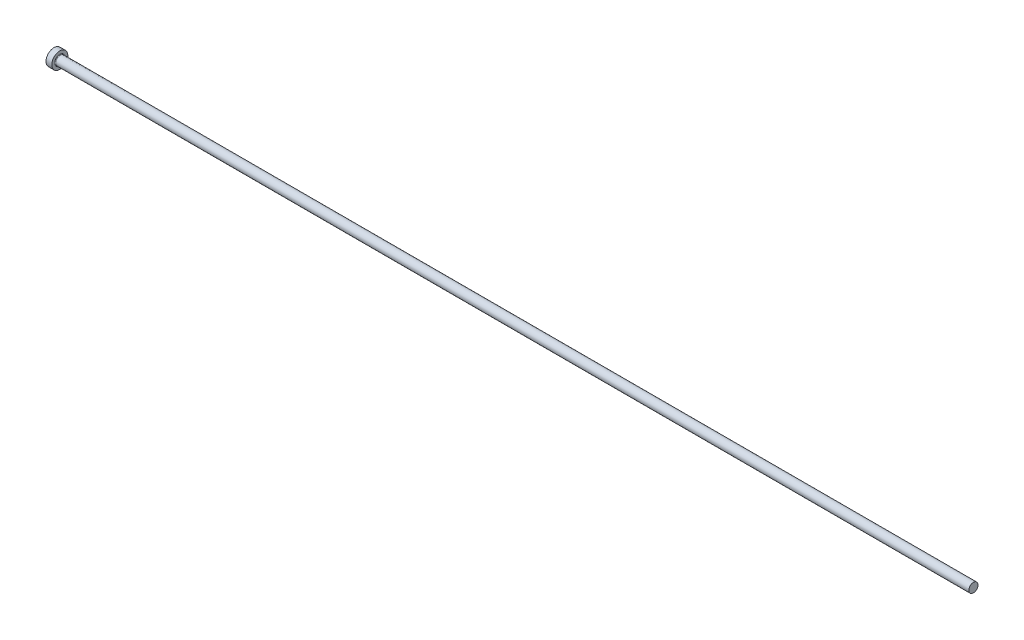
ISO-10303-21;
HEADER;
FILE_DESCRIPTION(('STEP AP214'),'2;1');
FILE_NAME('part.step','',(''),(''),'','','');
FILE_SCHEMA(('AUTOMOTIVE_DESIGN { 1 0 10303 214 1 1 1 1 }'));
ENDSEC;
DATA;
#1=APPLICATION_CONTEXT('core data for automotive mechanical design processes');
#2=APPLICATION_PROTOCOL_DEFINITION('international standard','automotive_design',2000,#1);
#3=PRODUCT_CONTEXT('',#1,'mechanical');
#4=PRODUCT('Part','Part','',(#3));
#5=PRODUCT_RELATED_PRODUCT_CATEGORY('part','',(#4));
#6=PRODUCT_DEFINITION_FORMATION('','',#4);
#7=PRODUCT_DEFINITION_CONTEXT('part definition',#1,'design');
#8=PRODUCT_DEFINITION('design','',#6,#7);
#9=PRODUCT_DEFINITION_SHAPE('','',#8);
#10=(LENGTH_UNIT() NAMED_UNIT(*) SI_UNIT(.MILLI.,.METRE.));
#11=(NAMED_UNIT(*) PLANE_ANGLE_UNIT() SI_UNIT($,.RADIAN.));
#12=(NAMED_UNIT(*) SI_UNIT($,.STERADIAN.) SOLID_ANGLE_UNIT());
#13=UNCERTAINTY_MEASURE_WITH_UNIT(LENGTH_MEASURE(1.E-05),#10,'distance_accuracy_value','');
#14=(GEOMETRIC_REPRESENTATION_CONTEXT(3) GLOBAL_UNCERTAINTY_ASSIGNED_CONTEXT((#13)) GLOBAL_UNIT_ASSIGNED_CONTEXT((#10,
#11,#12)) REPRESENTATION_CONTEXT('',''));
#15=CARTESIAN_POINT('',(0.,0.,0.));
#16=DIRECTION('',(0.,0.,1.));
#17=DIRECTION('',(1.,0.,0.));
#18=AXIS2_PLACEMENT_3D('',#15,#16,#17);
#19=CARTESIAN_POINT('',(0.,0.,0.));
#20=DIRECTION('',(-1.,0.,0.));
#21=DIRECTION('',(0.,-1.,0.));
#22=AXIS2_PLACEMENT_3D('',#19,#20,#21);
#23=PLANE('',#22);
#24=CARTESIAN_POINT('',(0.,0.,0.));
#25=DIRECTION('',(1.,0.,0.));
#26=DIRECTION('',(0.,1.,0.));
#27=AXIS2_PLACEMENT_3D('',#24,#25,#26);
#28=CIRCLE('',#27,7.);
#29=CARTESIAN_POINT('',(0.,7.,0.));
#30=VERTEX_POINT('',#29);
#31=EDGE_CURVE('E25',#30,#30,#28,.T.);
#32=ORIENTED_EDGE('',*,*,#31,.F.);
#33=EDGE_LOOP('',(#32));
#34=FACE_BOUND('',#33,.T.);
#35=ADVANCED_FACE('F14',(#34),#23,.T.);
#36=CARTESIAN_POINT('',(800.,0.,0.));
#37=DIRECTION('',(1.,0.,0.));
#38=DIRECTION('',(0.,1.,0.));
#39=AXIS2_PLACEMENT_3D('',#36,#37,#38);
#40=CYLINDRICAL_SURFACE('',#39,7.);
#41=ORIENTED_EDGE('',*,*,#31,.T.);
#42=EDGE_LOOP('',(#41));
#43=FACE_BOUND('',#42,.T.);
#44=CARTESIAN_POINT('',(5.,0.,0.));
#45=DIRECTION('',(1.,0.,0.));
#46=DIRECTION('',(0.,1.,0.));
#47=AXIS2_PLACEMENT_3D('',#44,#45,#46);
#48=CIRCLE('',#47,7.);
#49=CARTESIAN_POINT('',(5.,7.,0.));
#50=VERTEX_POINT('',#49);
#51=EDGE_CURVE('E29',#50,#50,#48,.T.);
#52=ORIENTED_EDGE('',*,*,#51,.F.);
#53=EDGE_LOOP('',(#52));
#54=FACE_BOUND('',#53,.T.);
#55=ADVANCED_FACE('F51',(#43,#54),#40,.T.);
#56=CARTESIAN_POINT('',(5.,7.,0.));
#57=DIRECTION('',(1.,0.,0.));
#58=DIRECTION('',(0.,1.,0.));
#59=AXIS2_PLACEMENT_3D('',#56,#57,#58);
#60=PLANE('',#59);
#61=CARTESIAN_POINT('',(5.,0.,0.));
#62=DIRECTION('',(1.,0.,0.));
#63=DIRECTION('',(0.,1.,0.));
#64=AXIS2_PLACEMENT_3D('',#61,#62,#63);
#65=CIRCLE('',#64,4.49999999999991);
#66=CARTESIAN_POINT('',(5.,4.49999999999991,0.));
#67=VERTEX_POINT('',#66);
#68=EDGE_CURVE('E9',#67,#67,#65,.F.);
#69=ORIENTED_EDGE('',*,*,#68,.T.);
#70=EDGE_LOOP('',(#69));
#71=FACE_BOUND('',#70,.T.);
#72=ORIENTED_EDGE('',*,*,#51,.T.);
#73=EDGE_LOOP('',(#72));
#74=FACE_BOUND('',#73,.T.);
#75=ADVANCED_FACE('F42',(#71,#74),#60,.T.);
#76=CARTESIAN_POINT('',(800.,0.,0.));
#77=DIRECTION('',(1.,0.,0.));
#78=DIRECTION('',(0.,1.,0.));
#79=AXIS2_PLACEMENT_3D('',#76,#77,#78);
#80=CYLINDRICAL_SURFACE('',#79,3.99999999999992);
#81=CARTESIAN_POINT('',(5.5,0.,0.));
#82=DIRECTION('',(1.,0.,0.));
#83=DIRECTION('',(0.,1.,0.));
#84=AXIS2_PLACEMENT_3D('',#81,#82,#83);
#85=CIRCLE('',#84,3.99999999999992);
#86=CARTESIAN_POINT('',(5.5,3.99999999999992,0.));
#87=VERTEX_POINT('',#86);
#88=EDGE_CURVE('E21',#87,#87,#85,.T.);
#89=ORIENTED_EDGE('',*,*,#88,.T.);
#90=EDGE_LOOP('',(#89));
#91=FACE_BOUND('',#90,.T.);
#92=CARTESIAN_POINT('',(800.,0.,0.));
#93=DIRECTION('',(1.,0.,0.));
#94=DIRECTION('',(0.,1.,0.));
#95=AXIS2_PLACEMENT_3D('',#92,#93,#94);
#96=CIRCLE('',#95,3.99999999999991);
#97=CARTESIAN_POINT('',(800.,3.99999999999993,0.));
#98=VERTEX_POINT('',#97);
#99=EDGE_CURVE('E34',#98,#98,#96,.T.);
#100=ORIENTED_EDGE('',*,*,#99,.F.);
#101=EDGE_LOOP('',(#100));
#102=FACE_BOUND('',#101,.T.);
#103=ADVANCED_FACE('F40',(#91,#102),#80,.T.);
#104=CARTESIAN_POINT('',(800.,3.99999999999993,0.));
#105=DIRECTION('',(1.,0.,0.));
#106=DIRECTION('',(0.,1.,0.));
#107=AXIS2_PLACEMENT_3D('',#104,#105,#106);
#108=PLANE('',#107);
#109=ORIENTED_EDGE('',*,*,#99,.T.);
#110=EDGE_LOOP('',(#109));
#111=FACE_BOUND('',#110,.T.);
#112=ADVANCED_FACE('F38',(#111),#108,.T.);
#113=CARTESIAN_POINT('',(5.5,0.,0.));
#114=DIRECTION('',(1.,0.,0.));
#115=DIRECTION('',(0.,1.,0.));
#116=AXIS2_PLACEMENT_3D('',#113,#114,#115);
#117=TOROIDAL_SURFACE('',#116,4.49999999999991,0.5);
#118=ORIENTED_EDGE('',*,*,#68,.F.);
#119=EDGE_LOOP('',(#118));
#120=FACE_BOUND('',#119,.T.);
#121=ORIENTED_EDGE('',*,*,#88,.F.);
#122=EDGE_LOOP('',(#121));
#123=FACE_BOUND('',#122,.T.);
#124=ADVANCED_FACE('F16',(#120,#123),#117,.F.);
#125=CLOSED_SHELL('',(#35,#55,#75,#103,#112,#124));
#126=MANIFOLD_SOLID_BREP('B1',#125);
#127=ADVANCED_BREP_SHAPE_REPRESENTATION('',(#18,#126),#14);
#128=SHAPE_DEFINITION_REPRESENTATION(#9,#127);
ENDSEC;
END-ISO-10303-21;
